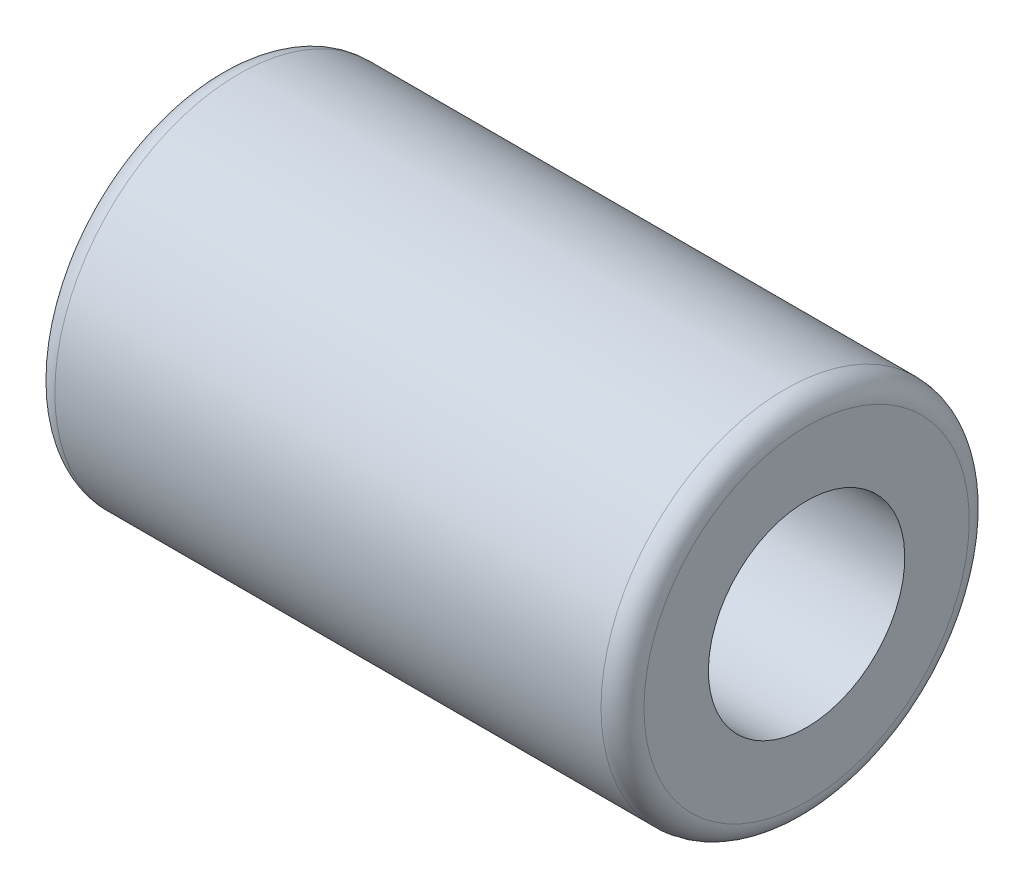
ISO-10303-21;
HEADER;
FILE_DESCRIPTION(('STEP AP214'),'2;1');
FILE_NAME('part.step','',(''),(''),'','','');
FILE_SCHEMA(('AUTOMOTIVE_DESIGN { 1 0 10303 214 1 1 1 1 }'));
ENDSEC;
DATA;
#1=APPLICATION_CONTEXT('core data for automotive mechanical design processes');
#2=APPLICATION_PROTOCOL_DEFINITION('international standard','automotive_design',2000,#1);
#3=PRODUCT_CONTEXT('',#1,'mechanical');
#4=PRODUCT('Part','Part','',(#3));
#5=PRODUCT_RELATED_PRODUCT_CATEGORY('part','',(#4));
#6=PRODUCT_DEFINITION_FORMATION('','',#4);
#7=PRODUCT_DEFINITION_CONTEXT('part definition',#1,'design');
#8=PRODUCT_DEFINITION('design','',#6,#7);
#9=PRODUCT_DEFINITION_SHAPE('','',#8);
#10=(LENGTH_UNIT() NAMED_UNIT(*) SI_UNIT(.MILLI.,.METRE.));
#11=(NAMED_UNIT(*) PLANE_ANGLE_UNIT() SI_UNIT($,.RADIAN.));
#12=(NAMED_UNIT(*) SI_UNIT($,.STERADIAN.) SOLID_ANGLE_UNIT());
#13=UNCERTAINTY_MEASURE_WITH_UNIT(LENGTH_MEASURE(1.E-05),#10,'distance_accuracy_value','');
#14=(GEOMETRIC_REPRESENTATION_CONTEXT(3) GLOBAL_UNCERTAINTY_ASSIGNED_CONTEXT((#13)) GLOBAL_UNIT_ASSIGNED_CONTEXT((#10,
#11,#12)) REPRESENTATION_CONTEXT('',''));
#15=CARTESIAN_POINT('',(0.,0.,0.));
#16=DIRECTION('',(0.,0.,1.));
#17=DIRECTION('',(1.,0.,0.));
#18=AXIS2_PLACEMENT_3D('',#15,#16,#17);
#19=CARTESIAN_POINT('',(0.,5.3125,0.));
#20=DIRECTION('',(-1.,0.,0.));
#21=DIRECTION('',(0.,1.,0.));
#22=AXIS2_PLACEMENT_3D('',#19,#20,#21);
#23=PLANE('',#22);
#24=CARTESIAN_POINT('',(0.,0.,0.));
#25=DIRECTION('',(1.,0.,0.));
#26=DIRECTION('',(0.,1.,0.));
#27=AXIS2_PLACEMENT_3D('',#24,#25,#26);
#28=CIRCLE('',#27,4.);
#29=CARTESIAN_POINT('',(0.,-4.,0.));
#30=VERTEX_POINT('',#29);
#31=EDGE_CURVE('E104',#30,#30,#28,.T.);
#32=ORIENTED_EDGE('',*,*,#31,.T.);
#33=EDGE_LOOP('',(#32));
#34=FACE_BOUND('',#33,.T.);
#35=CARTESIAN_POINT('',(0.,0.,0.));
#36=DIRECTION('',(1.,0.,0.));
#37=DIRECTION('',(0.,1.,0.));
#38=AXIS2_PLACEMENT_3D('',#35,#36,#37);
#39=CIRCLE('',#38,6.625);
#40=CARTESIAN_POINT('',(0.,6.625,0.));
#41=VERTEX_POINT('',#40);
#42=CARTESIAN_POINT('',(0.,0.,6.625));
#43=VERTEX_POINT('',#42);
#44=EDGE_CURVE('E108',#41,#43,#39,.T.);
#45=ORIENTED_EDGE('',*,*,#44,.F.);
#46=CARTESIAN_POINT('',(0.,0.,0.));
#47=DIRECTION('',(1.,0.,0.));
#48=DIRECTION('',(0.,1.,0.));
#49=AXIS2_PLACEMENT_3D('',#46,#47,#48);
#50=CIRCLE('',#49,6.625);
#51=EDGE_CURVE('E100',#43,#41,#50,.T.);
#52=ORIENTED_EDGE('',*,*,#51,.F.);
#53=EDGE_LOOP('',(#45,#52));
#54=FACE_BOUND('',#53,.T.);
#55=ADVANCED_FACE('F16',(#34,#54),#23,.T.);
#56=CARTESIAN_POINT('',(24.,5.3125,0.));
#57=DIRECTION('',(1.,0.,0.));
#58=DIRECTION('',(0.,1.,0.));
#59=AXIS2_PLACEMENT_3D('',#56,#57,#58);
#60=PLANE('',#59);
#61=CARTESIAN_POINT('',(24.,0.,0.));
#62=DIRECTION('',(1.,0.,0.));
#63=DIRECTION('',(0.,1.,0.));
#64=AXIS2_PLACEMENT_3D('',#61,#62,#63);
#65=CIRCLE('',#64,4.);
#66=CARTESIAN_POINT('',(24.,-4.,0.));
#67=VERTEX_POINT('',#66);
#68=EDGE_CURVE('E113',#67,#67,#65,.T.);
#69=ORIENTED_EDGE('',*,*,#68,.F.);
#70=EDGE_LOOP('',(#69));
#71=FACE_BOUND('',#70,.T.);
#72=CARTESIAN_POINT('',(24.,0.,0.));
#73=DIRECTION('',(1.,0.,0.));
#74=DIRECTION('',(0.,1.,0.));
#75=AXIS2_PLACEMENT_3D('',#72,#73,#74);
#76=CIRCLE('',#75,6.625);
#77=CARTESIAN_POINT('',(24.,6.625,0.));
#78=VERTEX_POINT('',#77);
#79=CARTESIAN_POINT('',(24.,0.,6.625));
#80=VERTEX_POINT('',#79);
#81=EDGE_CURVE('E97',#78,#80,#76,.T.);
#82=ORIENTED_EDGE('',*,*,#81,.T.);
#83=CARTESIAN_POINT('',(24.,0.,0.));
#84=DIRECTION('',(1.,0.,0.));
#85=DIRECTION('',(0.,1.,0.));
#86=AXIS2_PLACEMENT_3D('',#83,#84,#85);
#87=CIRCLE('',#86,6.625);
#88=EDGE_CURVE('E94',#80,#78,#87,.T.);
#89=ORIENTED_EDGE('',*,*,#88,.T.);
#90=EDGE_LOOP('',(#82,#89));
#91=FACE_BOUND('',#90,.T.);
#92=ADVANCED_FACE('F133',(#71,#91),#60,.T.);
#93=CARTESIAN_POINT('',(12.,0.,0.));
#94=DIRECTION('',(-1.,0.,0.));
#95=DIRECTION('',(0.,1.,0.));
#96=AXIS2_PLACEMENT_3D('',#93,#94,#95);
#97=CYLINDRICAL_SURFACE('',#96,7.5);
#98=CARTESIAN_POINT('',(0.875,0.,0.));
#99=DIRECTION('',(1.,0.,0.));
#100=DIRECTION('',(0.,1.,0.));
#101=AXIS2_PLACEMENT_3D('',#98,#99,#100);
#102=CIRCLE('',#101,7.5);
#103=CARTESIAN_POINT('',(0.875,-7.5,0.));
#104=VERTEX_POINT('',#103);
#105=CARTESIAN_POINT('',(0.875,0.,7.5));
#106=VERTEX_POINT('',#105);
#107=EDGE_CURVE('E77',#104,#106,#102,.T.);
#108=ORIENTED_EDGE('',*,*,#107,.T.);
#109=CARTESIAN_POINT('',(0.875,0.,0.));
#110=DIRECTION('',(1.,0.,0.));
#111=DIRECTION('',(0.,1.,0.));
#112=AXIS2_PLACEMENT_3D('',#109,#110,#111);
#113=CIRCLE('',#112,7.5);
#114=EDGE_CURVE('E79',#106,#104,#113,.T.);
#115=ORIENTED_EDGE('',*,*,#114,.T.);
#116=DIRECTION('',(1.,0.,0.));
#117=VECTOR('',#116,1.);
#118=CARTESIAN_POINT('',(12.,-7.5,0.));
#119=LINE('',#118,#117);
#120=CARTESIAN_POINT('',(23.125,-7.5,0.));
#121=VERTEX_POINT('',#120);
#122=EDGE_CURVE('E10',#104,#121,#119,.T.);
#123=ORIENTED_EDGE('',*,*,#122,.T.);
#124=CARTESIAN_POINT('',(23.125,0.,0.));
#125=DIRECTION('',(1.,0.,0.));
#126=DIRECTION('',(0.,1.,0.));
#127=AXIS2_PLACEMENT_3D('',#124,#125,#126);
#128=CIRCLE('',#127,7.5);
#129=CARTESIAN_POINT('',(23.125,0.,7.5));
#130=VERTEX_POINT('',#129);
#131=EDGE_CURVE('E120',#130,#121,#128,.T.);
#132=ORIENTED_EDGE('',*,*,#131,.F.);
#133=CARTESIAN_POINT('',(23.125,0.,0.));
#134=DIRECTION('',(1.,0.,0.));
#135=DIRECTION('',(0.,1.,0.));
#136=AXIS2_PLACEMENT_3D('',#133,#134,#135);
#137=CIRCLE('',#136,7.5);
#138=EDGE_CURVE('E19',#121,#130,#137,.T.);
#139=ORIENTED_EDGE('',*,*,#138,.F.);
#140=ORIENTED_EDGE('',*,*,#122,.F.);
#141=EDGE_LOOP('',(#108,#115,#123,#132,#139,#140));
#142=FACE_BOUND('',#141,.T.);
#143=ADVANCED_FACE('F75',(#142),#97,.T.);
#144=CARTESIAN_POINT('',(23.125,0.,0.));
#145=DIRECTION('',(1.,0.,0.));
#146=DIRECTION('',(0.,0.,-1.));
#147=AXIS2_PLACEMENT_3D('',#144,#145,#146);
#148=TOROIDAL_SURFACE('',#147,6.625,0.875);
#149=ORIENTED_EDGE('',*,*,#81,.F.);
#150=ORIENTED_EDGE('',*,*,#88,.F.);
#151=CARTESIAN_POINT('',(23.125,0.,6.625));
#152=DIRECTION('',(0.,-1.,0.));
#153=DIRECTION('',(0.,0.,1.));
#154=AXIS2_PLACEMENT_3D('',#151,#152,#153);
#155=CIRCLE('',#154,0.875);
#156=EDGE_CURVE('E92',#80,#130,#155,.T.);
#157=ORIENTED_EDGE('',*,*,#156,.T.);
#158=ORIENTED_EDGE('',*,*,#131,.T.);
#159=ORIENTED_EDGE('',*,*,#138,.T.);
#160=ORIENTED_EDGE('',*,*,#156,.F.);
#161=EDGE_LOOP('',(#149,#150,#157,#158,#159,#160));
#162=FACE_BOUND('',#161,.T.);
#163=ADVANCED_FACE('F131',(#162),#148,.T.);
#164=CARTESIAN_POINT('',(12.,0.,0.));
#165=DIRECTION('',(-1.,0.,0.));
#166=DIRECTION('',(0.,1.,0.));
#167=AXIS2_PLACEMENT_3D('',#164,#165,#166);
#168=CYLINDRICAL_SURFACE('',#167,4.);
#169=ORIENTED_EDGE('',*,*,#68,.T.);
#170=DIRECTION('',(-1.,0.,0.));
#171=VECTOR('',#170,1.);
#172=CARTESIAN_POINT('',(12.,-4.,0.));
#173=LINE('',#172,#171);
#174=EDGE_CURVE('E109',#67,#30,#173,.T.);
#175=ORIENTED_EDGE('',*,*,#174,.T.);
#176=ORIENTED_EDGE('',*,*,#31,.F.);
#177=ORIENTED_EDGE('',*,*,#174,.F.);
#178=EDGE_LOOP('',(#169,#175,#176,#177));
#179=FACE_BOUND('',#178,.T.);
#180=ADVANCED_FACE('F146',(#179),#168,.F.);
#181=CARTESIAN_POINT('',(0.875,0.,0.));
#182=DIRECTION('',(1.,0.,0.));
#183=DIRECTION('',(0.,0.,-1.));
#184=AXIS2_PLACEMENT_3D('',#181,#182,#183);
#185=TOROIDAL_SURFACE('',#184,6.625,0.875);
#186=ORIENTED_EDGE('',*,*,#107,.F.);
#187=ORIENTED_EDGE('',*,*,#114,.F.);
#188=CARTESIAN_POINT('',(0.875,0.,6.625));
#189=DIRECTION('',(0.,-1.,0.));
#190=DIRECTION('',(0.,0.,1.));
#191=AXIS2_PLACEMENT_3D('',#188,#189,#190);
#192=CIRCLE('',#191,0.875);
#193=EDGE_CURVE('E83',#106,#43,#192,.T.);
#194=ORIENTED_EDGE('',*,*,#193,.T.);
#195=ORIENTED_EDGE('',*,*,#51,.T.);
#196=ORIENTED_EDGE('',*,*,#44,.T.);
#197=ORIENTED_EDGE('',*,*,#193,.F.);
#198=EDGE_LOOP('',(#186,#187,#194,#195,#196,#197));
#199=FACE_BOUND('',#198,.T.);
#200=ADVANCED_FACE('F85',(#199),#185,.T.);
#201=CLOSED_SHELL('',(#55,#92,#143,#163,#180,#200));
#202=MANIFOLD_SOLID_BREP('B1',#201);
#203=ADVANCED_BREP_SHAPE_REPRESENTATION('',(#18,#202),#14);
#204=SHAPE_DEFINITION_REPRESENTATION(#9,#203);
ENDSEC;
END-ISO-10303-21;
